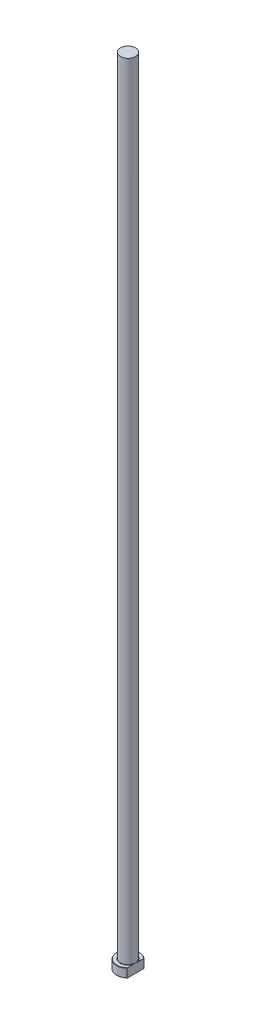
ISO-10303-21;
HEADER;
FILE_DESCRIPTION(('STEP AP214'),'2;1');
FILE_NAME('part.step','',(''),(''),'','','');
FILE_SCHEMA(('AUTOMOTIVE_DESIGN { 1 0 10303 214 1 1 1 1 }'));
ENDSEC;
DATA;
#1=APPLICATION_CONTEXT('core data for automotive mechanical design processes');
#2=APPLICATION_PROTOCOL_DEFINITION('international standard','automotive_design',2000,#1);
#3=PRODUCT_CONTEXT('',#1,'mechanical');
#4=PRODUCT('Part','Part','',(#3));
#5=PRODUCT_RELATED_PRODUCT_CATEGORY('part','',(#4));
#6=PRODUCT_DEFINITION_FORMATION('','',#4);
#7=PRODUCT_DEFINITION_CONTEXT('part definition',#1,'design');
#8=PRODUCT_DEFINITION('design','',#6,#7);
#9=PRODUCT_DEFINITION_SHAPE('','',#8);
#10=(LENGTH_UNIT() NAMED_UNIT(*) SI_UNIT(.MILLI.,.METRE.));
#11=(NAMED_UNIT(*) PLANE_ANGLE_UNIT() SI_UNIT($,.RADIAN.));
#12=(NAMED_UNIT(*) SI_UNIT($,.STERADIAN.) SOLID_ANGLE_UNIT());
#13=UNCERTAINTY_MEASURE_WITH_UNIT(LENGTH_MEASURE(1.E-05),#10,'distance_accuracy_value','');
#14=(GEOMETRIC_REPRESENTATION_CONTEXT(3) GLOBAL_UNCERTAINTY_ASSIGNED_CONTEXT((#13)) GLOBAL_UNIT_ASSIGNED_CONTEXT((#10,
#11,#12)) REPRESENTATION_CONTEXT('',''));
#15=CARTESIAN_POINT('',(0.,0.,0.));
#16=DIRECTION('',(0.,0.,1.));
#17=DIRECTION('',(1.,0.,0.));
#18=AXIS2_PLACEMENT_3D('',#15,#16,#17);
#19=CARTESIAN_POINT('',(0.,0.,0.));
#20=DIRECTION('',(0.,-1.,0.));
#21=DIRECTION('',(0.,0.,-1.));
#22=AXIS2_PLACEMENT_3D('',#19,#20,#21);
#23=PLANE('',#22);
#24=CARTESIAN_POINT('',(0.,0.,0.));
#25=DIRECTION('',(0.,-1.,0.));
#26=DIRECTION('',(0.,0.,-1.));
#27=AXIS2_PLACEMENT_3D('',#24,#25,#26);
#28=CIRCLE('',#27,8.79999999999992);
#29=CARTESIAN_POINT('',(5.99999999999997,0.,6.43739077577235));
#30=VERTEX_POINT('',#29);
#31=CARTESIAN_POINT('',(5.99999999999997,0.,-6.43739077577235));
#32=VERTEX_POINT('',#31);
#33=EDGE_CURVE('E98',#30,#32,#28,.T.);
#34=ORIENTED_EDGE('',*,*,#33,.T.);
#35=DIRECTION('',(0.,0.,1.));
#36=VECTOR('',#35,1.);
#37=CARTESIAN_POINT('',(5.99999999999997,0.,-6.70820393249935));
#38=LINE('',#37,#36);
#39=EDGE_CURVE('E83',#32,#30,#38,.T.);
#40=ORIENTED_EDGE('',*,*,#39,.T.);
#41=EDGE_LOOP('',(#34,#40));
#42=FACE_BOUND('',#41,.T.);
#43=ADVANCED_FACE('F32',(#42),#23,.T.);
#44=CARTESIAN_POINT('',(0.,259.958771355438,0.));
#45=DIRECTION('',(0.,1.,0.));
#46=DIRECTION('',(0.,0.,1.));
#47=AXIS2_PLACEMENT_3D('',#44,#45,#46);
#48=CYLINDRICAL_SURFACE('',#47,8.99999999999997);
#49=CARTESIAN_POINT('',(0.,6.79999999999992,0.));
#50=DIRECTION('',(0.,1.,0.));
#51=DIRECTION('',(0.,0.,1.));
#52=AXIS2_PLACEMENT_3D('',#49,#50,#51);
#53=CIRCLE('',#52,8.99999999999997);
#54=CARTESIAN_POINT('',(5.99999999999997,6.79999999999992,6.70820393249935));
#55=VERTEX_POINT('',#54);
#56=CARTESIAN_POINT('',(5.99999999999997,6.79999999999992,-6.70820393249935));
#57=VERTEX_POINT('',#56);
#58=EDGE_CURVE('E104',#55,#57,#53,.F.);
#59=ORIENTED_EDGE('',*,*,#58,.T.);
#60=DIRECTION('',(0.,-1.,0.));
#61=VECTOR('',#60,1.);
#62=CARTESIAN_POINT('',(5.99999999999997,630.,-6.70820393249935));
#63=LINE('',#62,#61);
#64=CARTESIAN_POINT('',(5.99999999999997,0.200000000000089,-6.70820393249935));
#65=VERTEX_POINT('',#64);
#66=EDGE_CURVE('E183',#57,#65,#63,.T.);
#67=ORIENTED_EDGE('',*,*,#66,.T.);
#68=CARTESIAN_POINT('',(0.,0.200000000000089,0.));
#69=DIRECTION('',(0.,-1.,0.));
#70=DIRECTION('',(0.,0.,-1.));
#71=AXIS2_PLACEMENT_3D('',#68,#69,#70);
#72=CIRCLE('',#71,8.99999999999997);
#73=CARTESIAN_POINT('',(5.99999999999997,0.200000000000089,6.70820393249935));
#74=VERTEX_POINT('',#73);
#75=EDGE_CURVE('E100',#65,#74,#72,.F.);
#76=ORIENTED_EDGE('',*,*,#75,.T.);
#77=DIRECTION('',(0.,-1.,0.));
#78=VECTOR('',#77,1.);
#79=CARTESIAN_POINT('',(5.99999999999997,630.,6.70820393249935));
#80=LINE('',#79,#78);
#81=EDGE_CURVE('E93',#55,#74,#80,.T.);
#82=ORIENTED_EDGE('',*,*,#81,.F.);
#83=EDGE_LOOP('',(#59,#67,#76,#82));
#84=FACE_BOUND('',#83,.T.);
#85=ADVANCED_FACE('F158',(#84),#48,.T.);
#86=CARTESIAN_POINT('',(-8.99999999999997,7.,0.));
#87=DIRECTION('',(0.,1.,0.));
#88=DIRECTION('',(0.,0.,1.));
#89=AXIS2_PLACEMENT_3D('',#86,#87,#88);
#90=PLANE('',#89);
#91=CARTESIAN_POINT('',(0.,7.,0.));
#92=DIRECTION('',(0.,1.,0.));
#93=DIRECTION('',(0.,0.,1.));
#94=AXIS2_PLACEMENT_3D('',#91,#92,#93);
#95=CIRCLE('',#94,8.79999999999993);
#96=CARTESIAN_POINT('',(5.99999999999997,7.,-6.43739077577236));
#97=VERTEX_POINT('',#96);
#98=CARTESIAN_POINT('',(5.99999999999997,7.,6.43739077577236));
#99=VERTEX_POINT('',#98);
#100=EDGE_CURVE('E178',#97,#99,#95,.T.);
#101=ORIENTED_EDGE('',*,*,#100,.T.);
#102=DIRECTION('',(0.,0.,-1.));
#103=VECTOR('',#102,1.);
#104=CARTESIAN_POINT('',(5.99999999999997,7.,0.));
#105=LINE('',#104,#103);
#106=CARTESIAN_POINT('',(5.99999999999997,6.99999999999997,1.92093727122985));
#107=VERTEX_POINT('',#106);
#108=EDGE_CURVE('E57',#99,#107,#105,.T.);
#109=ORIENTED_EDGE('',*,*,#108,.T.);
#110=CARTESIAN_POINT('',(0.,7.,0.));
#111=DIRECTION('',(0.,1.,0.));
#112=DIRECTION('',(0.,0.,1.));
#113=AXIS2_PLACEMENT_3D('',#110,#111,#112);
#114=CIRCLE('',#113,6.29999999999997);
#115=CARTESIAN_POINT('',(5.99999999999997,6.99999999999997,-1.92093727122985));
#116=VERTEX_POINT('',#115);
#117=EDGE_CURVE('E107',#107,#116,#114,.F.);
#118=ORIENTED_EDGE('',*,*,#117,.T.);
#119=EDGE_CURVE('E136',#116,#97,#105,.T.);
#120=ORIENTED_EDGE('',*,*,#119,.T.);
#121=EDGE_LOOP('',(#101,#109,#118,#120));
#122=FACE_BOUND('',#121,.T.);
#123=ADVANCED_FACE('F147',(#122),#90,.T.);
#124=CARTESIAN_POINT('',(0.,7.00000000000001,0.));
#125=DIRECTION('',(0.,-1.,0.));
#126=DIRECTION('',(0.,0.,-1.));
#127=AXIS2_PLACEMENT_3D('',#124,#125,#126);
#128=CONICAL_SURFACE('',#127,8.79999999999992,0.785398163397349);
#129=ORIENTED_EDGE('',*,*,#58,.F.);
#130=CARTESIAN_POINT('',(5.99999999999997,-0.132115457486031,14.7591430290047));
#131=CARTESIAN_POINT('',(5.99999999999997,0.0733919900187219,14.5372990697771));
#132=CARTESIAN_POINT('',(5.99999999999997,0.278550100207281,14.315131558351));
#133=CARTESIAN_POINT('',(5.99999999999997,0.688060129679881,13.8700519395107));
#134=CARTESIAN_POINT('',(5.99999999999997,0.892412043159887,13.6471398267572));
#135=CARTESIAN_POINT('',(5.99999999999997,1.50418032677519,12.9770492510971));
#136=CARTESIAN_POINT('',(5.99999999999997,1.91022091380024,12.5286117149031));
#137=CARTESIAN_POINT('',(5.99999999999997,2.71980134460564,11.624642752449));
#138=CARTESIAN_POINT('',(5.99999999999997,3.12331180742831,11.1690849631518));
#139=CARTESIAN_POINT('',(5.99999999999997,3.92341525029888,10.2520077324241));
#140=CARTESIAN_POINT('',(5.99999999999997,4.32000903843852,9.79048899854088));
#141=CARTESIAN_POINT('',(5.99999999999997,5.02478816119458,8.95241885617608));
#142=CARTESIAN_POINT('',(5.99999999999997,5.33476112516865,8.57737771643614));
#143=CARTESIAN_POINT('',(5.99999999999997,5.79310598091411,8.00939108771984));
#144=CARTESIAN_POINT('',(5.99999999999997,5.9448056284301,7.81913145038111));
#145=CARTESIAN_POINT('',(5.99999999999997,6.24553651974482,7.43651727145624));
#146=CARTESIAN_POINT('',(5.99999999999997,6.39456781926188,7.24416277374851));
#147=CARTESIAN_POINT('',(5.99999999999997,6.68925367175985,6.85721540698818));
#148=CARTESIAN_POINT('',(5.99999999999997,6.83491177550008,6.66262524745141));
#149=CARTESIAN_POINT('',(5.99999999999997,7.12230719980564,6.27057707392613));
#150=CARTESIAN_POINT('',(5.99999999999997,7.2640447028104,6.07311919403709));
#151=CARTESIAN_POINT('',(5.99999999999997,7.54263362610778,5.67488713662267));
#152=CARTESIAN_POINT('',(5.99999999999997,7.67948689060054,5.47411425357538));
#153=CARTESIAN_POINT('',(5.99999999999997,7.94714213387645,5.06858845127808));
#154=CARTESIAN_POINT('',(5.99999999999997,8.07794479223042,4.86383598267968));
#155=CARTESIAN_POINT('',(5.99999999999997,8.32827993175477,4.45554322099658));
#156=CARTESIAN_POINT('',(5.99999999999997,8.4480277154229,4.25213564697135));
#157=CARTESIAN_POINT('',(5.99999999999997,8.6783797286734,3.8401373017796));
#158=CARTESIAN_POINT('',(5.99999999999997,8.78898293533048,3.63154595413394));
#159=CARTESIAN_POINT('',(5.99999999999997,8.99840984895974,3.20863811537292));
#160=CARTESIAN_POINT('',(5.99999999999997,9.09724073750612,2.99432521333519));
#161=CARTESIAN_POINT('',(5.99999999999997,9.27991776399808,2.55937061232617));
#162=CARTESIAN_POINT('',(5.99999999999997,9.36376811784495,2.33873071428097));
#163=CARTESIAN_POINT('',(5.99999999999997,9.49627737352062,1.94012294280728));
#164=CARTESIAN_POINT('',(5.99999999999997,9.54862178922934,1.76338731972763));
#165=CARTESIAN_POINT('',(5.99999999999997,9.63978035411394,1.40643307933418));
#166=CARTESIAN_POINT('',(5.99999999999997,9.67859618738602,1.22621489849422));
#167=CARTESIAN_POINT('',(5.99999999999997,9.74077317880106,0.863704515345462));
#168=CARTESIAN_POINT('',(5.99999999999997,9.76418479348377,0.681421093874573));
#169=CARTESIAN_POINT('',(5.99999999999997,9.79447814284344,0.315473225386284));
#170=CARTESIAN_POINT('',(5.99999999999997,9.80136083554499,0.131808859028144));
#171=CARTESIAN_POINT('',(5.99999999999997,9.79818788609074,-0.235881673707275));
#172=CARTESIAN_POINT('',(5.99999999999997,9.78808514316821,-0.419907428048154));
#173=CARTESIAN_POINT('',(5.99999999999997,9.75144464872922,-0.786302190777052));
#174=CARTESIAN_POINT('',(5.99999999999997,9.7249055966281,-0.96867106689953));
#175=CARTESIAN_POINT('',(5.99999999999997,9.65670736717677,-1.33110767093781));
#176=CARTESIAN_POINT('',(5.99999999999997,9.61500120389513,-1.5111664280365));
#177=CARTESIAN_POINT('',(5.99999999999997,9.51838325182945,-1.86766519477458));
#178=CARTESIAN_POINT('',(5.99999999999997,9.46347085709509,-2.04410503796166));
#179=CARTESIAN_POINT('',(5.99999999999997,9.33563659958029,-2.41270922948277));
#180=CARTESIAN_POINT('',(5.99999999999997,9.26138327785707,-2.60440790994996));
#181=CARTESIAN_POINT('',(5.99999999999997,9.10155310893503,-2.98306496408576));
#182=CARTESIAN_POINT('',(5.99999999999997,9.01597146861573,-3.1700212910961));
#183=CARTESIAN_POINT('',(5.99999999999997,8.83553473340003,-3.53975380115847));
#184=CARTESIAN_POINT('',(5.99999999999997,8.74066449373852,-3.72252253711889));
#185=CARTESIAN_POINT('',(5.99999999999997,8.54355472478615,-4.08398624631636));
#186=CARTESIAN_POINT('',(5.99999999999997,8.44131612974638,-4.26268173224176));
#187=CARTESIAN_POINT('',(5.99999999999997,8.2295396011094,-4.61872309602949));
#188=CARTESIAN_POINT('',(5.99999999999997,8.11992610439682,-4.79602381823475));
#189=CARTESIAN_POINT('',(5.99999999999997,7.89571048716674,-5.14743548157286));
#190=CARTESIAN_POINT('',(5.99999999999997,7.78110825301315,-5.32154634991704));
#191=CARTESIAN_POINT('',(5.99999999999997,7.54792782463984,-5.6668232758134));
#192=CARTESIAN_POINT('',(5.99999999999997,7.42935372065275,-5.83799210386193));
#193=CARTESIAN_POINT('',(5.99999999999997,7.18881616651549,-6.17793707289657));
#194=CARTESIAN_POINT('',(5.99999999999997,7.06685256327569,-6.34671310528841));
#195=CARTESIAN_POINT('',(5.99999999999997,6.80539778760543,-6.70216781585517));
#196=CARTESIAN_POINT('',(5.99999999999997,6.6655496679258,-6.88858356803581));
#197=CARTESIAN_POINT('',(5.99999999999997,6.38292065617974,-7.25918139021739));
#198=CARTESIAN_POINT('',(5.99999999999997,6.24013967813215,-7.44336339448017));
#199=CARTESIAN_POINT('',(5.99999999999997,5.80812002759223,-7.99307414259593));
#200=CARTESIAN_POINT('',(5.99999999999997,5.51523002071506,-8.35573349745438));
#201=CARTESIAN_POINT('',(5.99999999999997,4.92224619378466,-9.07562940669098));
#202=CARTESIAN_POINT('',(5.99999999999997,4.62214609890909,-9.43286076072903));
#203=CARTESIAN_POINT('',(5.99999999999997,4.01677382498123,-10.1429201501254));
#204=CARTESIAN_POINT('',(5.99999999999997,3.71150152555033,-10.495748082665));
#205=CARTESIAN_POINT('',(5.99999999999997,3.11456796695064,-11.177916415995));
#206=CARTESIAN_POINT('',(5.99999999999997,2.82312451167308,-11.5074478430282));
#207=CARTESIAN_POINT('',(5.99999999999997,2.23747184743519,-12.1640528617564));
#208=CARTESIAN_POINT('',(5.99999999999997,1.94326258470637,-12.4911264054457));
#209=CARTESIAN_POINT('',(5.99999999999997,1.35320776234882,-13.1426363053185));
#210=CARTESIAN_POINT('',(5.99999999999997,1.05736649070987,-13.4670765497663));
#211=CARTESIAN_POINT('',(5.99999999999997,0.463882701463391,-14.1142803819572));
#212=CARTESIAN_POINT('',(5.99999999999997,0.16624026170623,-14.4370440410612));
#213=CARTESIAN_POINT('',(5.99999999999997,-0.13211545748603,-14.7591430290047));
#214=B_SPLINE_CURVE_WITH_KNOTS('',3,(#130,#131,#132,#133,#134,#135,#136,#137,#138,#139,#140,
#141,#142,#143,#144,#145,#146,#147,#148,#149,#150,#151,#152,#153,#154,#155,#156,#157,#158,#159,
#160,#161,#162,#163,#164,#165,#166,#167,#168,#169,#170,#171,#172,#173,#174,#175,#176,#177,#178,
#179,#180,#181,#182,#183,#184,#185,#186,#187,#188,#189,#190,#191,#192,#193,#194,#195,#196,#197,
#198,#199,#200,#201,#202,#203,#204,#205,#206,#207,#208,#209,#210,#211,#212,#213),.UNSPECIFIED.,
.F.,.F.,(4,2,2,2,2,2,2,2,2,2,2,2,2,2,2,2,2,2,2,2,2,2,2,2,2,2,2,2,2,2,2,2,2,2,2,2,2,2,2,2,2,4),
(0.,0.907210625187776,1.81442776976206,3.62925156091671,5.4549048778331,7.28034345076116,
8.73990838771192,9.46989218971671,10.1998607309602,10.9290223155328,11.6581499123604,
12.3869992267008,13.1157664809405,13.8236973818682,14.5317073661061,15.2392832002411,
15.9466595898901,16.4991819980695,17.0516356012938,17.6022705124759,18.1528735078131,
18.7050058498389,19.2571818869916,19.8110832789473,20.3650100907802,20.9812908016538,
21.597833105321,22.2153979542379,22.8328846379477,23.4581285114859,24.0833866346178,
24.7080195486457,25.3326807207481,26.0317691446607,26.7308780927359,28.1292235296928,
29.5288334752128,30.9284760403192,32.2482200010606,33.567989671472,34.8851960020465,
36.2023458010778),.UNSPECIFIED.);
#215=EDGE_CURVE('E135',#55,#99,#214,.T.);
#216=ORIENTED_EDGE('',*,*,#215,.T.);
#217=ORIENTED_EDGE('',*,*,#100,.F.);
#218=EDGE_CURVE('E127',#97,#57,#214,.T.);
#219=ORIENTED_EDGE('',*,*,#218,.T.);
#220=EDGE_LOOP('',(#129,#216,#217,#219));
#221=FACE_BOUND('',#220,.T.);
#222=ADVANCED_FACE('F143',(#221),#128,.T.);
#223=CARTESIAN_POINT('',(0.,0.200000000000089,0.));
#224=DIRECTION('',(0.,1.,0.));
#225=DIRECTION('',(0.,0.,1.));
#226=AXIS2_PLACEMENT_3D('',#223,#224,#225);
#227=CONICAL_SURFACE('',#226,8.99999999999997,0.785398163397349);
#228=ORIENTED_EDGE('',*,*,#75,.F.);
#229=CARTESIAN_POINT('',(5.99999999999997,7.13211545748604,-14.7591430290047));
#230=CARTESIAN_POINT('',(5.99999999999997,6.92660800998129,-14.5372990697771));
#231=CARTESIAN_POINT('',(5.99999999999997,6.72144989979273,-14.315131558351));
#232=CARTESIAN_POINT('',(5.99999999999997,6.31193987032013,-13.8700519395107));
#233=CARTESIAN_POINT('',(5.99999999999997,6.10758795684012,-13.6471398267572));
#234=CARTESIAN_POINT('',(5.99999999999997,5.49581967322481,-12.9770492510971));
#235=CARTESIAN_POINT('',(5.99999999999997,5.08977908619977,-12.5286117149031));
#236=CARTESIAN_POINT('',(5.99999999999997,4.28019865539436,-11.624642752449));
#237=CARTESIAN_POINT('',(5.99999999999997,3.87668819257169,-11.1690849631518));
#238=CARTESIAN_POINT('',(5.99999999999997,3.07658474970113,-10.2520077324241));
#239=CARTESIAN_POINT('',(5.99999999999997,2.67999096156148,-9.79048899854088));
#240=CARTESIAN_POINT('',(5.99999999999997,1.97521183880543,-8.95241885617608));
#241=CARTESIAN_POINT('',(5.99999999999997,1.66523887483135,-8.57737771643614));
#242=CARTESIAN_POINT('',(5.99999999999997,1.2068940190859,-8.00939108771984));
#243=CARTESIAN_POINT('',(5.99999999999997,1.05519437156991,-7.81913145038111));
#244=CARTESIAN_POINT('',(5.99999999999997,0.754463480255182,-7.43651727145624));
#245=CARTESIAN_POINT('',(5.99999999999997,0.605432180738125,-7.24416277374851));
#246=CARTESIAN_POINT('',(5.99999999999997,0.310746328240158,-6.85721540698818));
#247=CARTESIAN_POINT('',(5.99999999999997,0.165088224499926,-6.66262524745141));
#248=CARTESIAN_POINT('',(5.99999999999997,-0.122307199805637,-6.27057707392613));
#249=CARTESIAN_POINT('',(5.99999999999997,-0.264044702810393,-6.07311919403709));
#250=CARTESIAN_POINT('',(5.99999999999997,-0.542633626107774,-5.67488713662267));
#251=CARTESIAN_POINT('',(5.99999999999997,-0.679486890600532,-5.47411425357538));
#252=CARTESIAN_POINT('',(5.99999999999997,-0.947142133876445,-5.06858845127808));
#253=CARTESIAN_POINT('',(5.99999999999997,-1.07794479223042,-4.86383598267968));
#254=CARTESIAN_POINT('',(5.99999999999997,-1.32827993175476,-4.45554322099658));
#255=CARTESIAN_POINT('',(5.99999999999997,-1.44802771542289,-4.25213564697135));
#256=CARTESIAN_POINT('',(5.99999999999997,-1.6783797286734,-3.8401373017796));
#257=CARTESIAN_POINT('',(5.99999999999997,-1.78898293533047,-3.63154595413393));
#258=CARTESIAN_POINT('',(5.99999999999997,-1.99840984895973,-3.20863811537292));
#259=CARTESIAN_POINT('',(5.99999999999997,-2.09724073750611,-2.99432521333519));
#260=CARTESIAN_POINT('',(5.99999999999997,-2.27991776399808,-2.55937061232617));
#261=CARTESIAN_POINT('',(5.99999999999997,-2.36376811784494,-2.33873071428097));
#262=CARTESIAN_POINT('',(5.99999999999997,-2.49627737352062,-1.94012294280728));
#263=CARTESIAN_POINT('',(5.99999999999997,-2.54862178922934,-1.76338731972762));
#264=CARTESIAN_POINT('',(5.99999999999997,-2.63978035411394,-1.40643307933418));
#265=CARTESIAN_POINT('',(5.99999999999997,-2.67859618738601,-1.22621489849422));
#266=CARTESIAN_POINT('',(5.99999999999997,-2.74077317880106,-0.86370451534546));
#267=CARTESIAN_POINT('',(5.99999999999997,-2.76418479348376,-0.681421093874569));
#268=CARTESIAN_POINT('',(5.99999999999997,-2.79447814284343,-0.315473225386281));
#269=CARTESIAN_POINT('',(5.99999999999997,-2.80136083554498,-0.131808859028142));
#270=CARTESIAN_POINT('',(5.99999999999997,-2.79818788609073,0.235881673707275));
#271=CARTESIAN_POINT('',(5.99999999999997,-2.7880851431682,0.419907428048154));
#272=CARTESIAN_POINT('',(5.99999999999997,-2.75144464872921,0.786302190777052));
#273=CARTESIAN_POINT('',(5.99999999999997,-2.7249055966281,0.96867106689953));
#274=CARTESIAN_POINT('',(5.99999999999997,-2.65670736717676,1.33110767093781));
#275=CARTESIAN_POINT('',(5.99999999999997,-2.61500120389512,1.5111664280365));
#276=CARTESIAN_POINT('',(5.99999999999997,-2.51838325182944,1.86766519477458));
#277=CARTESIAN_POINT('',(5.99999999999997,-2.46347085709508,2.04410503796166));
#278=CARTESIAN_POINT('',(5.99999999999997,-2.33563659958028,2.41270922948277));
#279=CARTESIAN_POINT('',(5.99999999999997,-2.26138327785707,2.60440790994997));
#280=CARTESIAN_POINT('',(5.99999999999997,-2.10155310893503,2.98306496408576));
#281=CARTESIAN_POINT('',(5.99999999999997,-2.01597146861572,3.17002129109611));
#282=CARTESIAN_POINT('',(5.99999999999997,-1.83553473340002,3.53975380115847));
#283=CARTESIAN_POINT('',(5.99999999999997,-1.74066449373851,3.7225225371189));
#284=CARTESIAN_POINT('',(5.99999999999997,-1.54355472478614,4.08398624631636));
#285=CARTESIAN_POINT('',(5.99999999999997,-1.44131612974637,4.26268173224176));
#286=CARTESIAN_POINT('',(5.99999999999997,-1.22953960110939,4.6187230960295));
#287=CARTESIAN_POINT('',(5.99999999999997,-1.11992610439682,4.79602381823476));
#288=CARTESIAN_POINT('',(5.99999999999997,-0.895710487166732,5.14743548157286));
#289=CARTESIAN_POINT('',(5.99999999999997,-0.781108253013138,5.32154634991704));
#290=CARTESIAN_POINT('',(5.99999999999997,-0.547927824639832,5.6668232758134));
#291=CARTESIAN_POINT('',(5.99999999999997,-0.429353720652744,5.83799210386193));
#292=CARTESIAN_POINT('',(5.99999999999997,-0.188816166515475,6.17793707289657));
#293=CARTESIAN_POINT('',(5.99999999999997,-0.0668525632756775,6.34671310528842));
#294=CARTESIAN_POINT('',(5.99999999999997,0.194602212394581,6.70216781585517));
#295=CARTESIAN_POINT('',(5.99999999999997,0.334450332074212,6.88858356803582));
#296=CARTESIAN_POINT('',(5.99999999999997,0.617079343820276,7.2591813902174));
#297=CARTESIAN_POINT('',(5.99999999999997,0.759860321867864,7.44336339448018));
#298=CARTESIAN_POINT('',(5.99999999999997,1.19187997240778,7.99307414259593));
#299=CARTESIAN_POINT('',(5.99999999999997,1.48476997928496,8.35573349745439));
#300=CARTESIAN_POINT('',(5.99999999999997,2.07775380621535,9.07562940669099));
#301=CARTESIAN_POINT('',(5.99999999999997,2.37785390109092,9.43286076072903));
#302=CARTESIAN_POINT('',(5.99999999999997,2.98322617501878,10.1429201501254));
#303=CARTESIAN_POINT('',(5.99999999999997,3.28849847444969,10.495748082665));
#304=CARTESIAN_POINT('',(5.99999999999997,3.88543203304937,11.177916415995));
#305=CARTESIAN_POINT('',(5.99999999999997,4.17687548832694,11.5074478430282));
#306=CARTESIAN_POINT('',(5.99999999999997,4.76252815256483,12.1640528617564));
#307=CARTESIAN_POINT('',(5.99999999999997,5.05673741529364,12.4911264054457));
#308=CARTESIAN_POINT('',(5.99999999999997,5.64679223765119,13.1426363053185));
#309=CARTESIAN_POINT('',(5.99999999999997,5.94263350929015,13.4670765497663));
#310=CARTESIAN_POINT('',(5.99999999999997,6.53611729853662,14.1142803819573));
#311=CARTESIAN_POINT('',(5.99999999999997,6.83375973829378,14.4370440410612));
#312=CARTESIAN_POINT('',(5.99999999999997,7.13211545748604,14.7591430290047));
#313=B_SPLINE_CURVE_WITH_KNOTS('',3,(#229,#230,#231,#232,#233,#234,#235,#236,#237,#238,#239,
#240,#241,#242,#243,#244,#245,#246,#247,#248,#249,#250,#251,#252,#253,#254,#255,#256,#257,#258,
#259,#260,#261,#262,#263,#264,#265,#266,#267,#268,#269,#270,#271,#272,#273,#274,#275,#276,#277,
#278,#279,#280,#281,#282,#283,#284,#285,#286,#287,#288,#289,#290,#291,#292,#293,#294,#295,#296,
#297,#298,#299,#300,#301,#302,#303,#304,#305,#306,#307,#308,#309,#310,#311,#312),.UNSPECIFIED.,
.F.,.F.,(4,2,2,2,2,2,2,2,2,2,2,2,2,2,2,2,2,2,2,2,2,2,2,2,2,2,2,2,2,2,2,2,2,2,2,2,2,2,2,2,2,4),
(0.,0.907210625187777,1.81442776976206,3.62925156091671,5.4549048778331,7.28034345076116,
8.73990838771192,9.46989218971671,10.1998607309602,10.9290223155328,11.6581499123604,
12.3869992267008,13.1157664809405,13.8236973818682,14.5317073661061,15.2392832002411,
15.9466595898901,16.4991819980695,17.0516356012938,17.6022705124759,18.1528735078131,
18.7050058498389,19.2571818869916,19.8110832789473,20.3650100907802,20.9812908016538,
21.597833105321,22.2153979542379,22.8328846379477,23.4581285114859,24.0833866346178,
24.7080195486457,25.3326807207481,26.0317691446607,26.7308780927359,28.1292235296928,
29.5288334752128,30.9284760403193,32.2482200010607,33.567989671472,34.8851960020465,
36.2023458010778),.UNSPECIFIED.);
#314=EDGE_CURVE('E86',#65,#32,#313,.T.);
#315=ORIENTED_EDGE('',*,*,#314,.T.);
#316=ORIENTED_EDGE('',*,*,#33,.F.);
#317=EDGE_CURVE('E89',#30,#74,#313,.T.);
#318=ORIENTED_EDGE('',*,*,#317,.T.);
#319=EDGE_LOOP('',(#228,#315,#316,#318));
#320=FACE_BOUND('',#319,.T.);
#321=ADVANCED_FACE('F97',(#320),#227,.T.);
#322=CARTESIAN_POINT('',(0.,7.29999999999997,0.));
#323=DIRECTION('',(0.,1.,0.));
#324=DIRECTION('',(0.,0.,1.));
#325=AXIS2_PLACEMENT_3D('',#322,#323,#324);
#326=TOROIDAL_SURFACE('',#325,6.29999999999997,0.3);
#327=CARTESIAN_POINT('',(5.99999999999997,7.29999999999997,0.));
#328=CARTESIAN_POINT('',(5.99999999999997,7.30000062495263,1.34604287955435E-10));
#329=CARTESIAN_POINT('',(5.99999999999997,7.30000124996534,-2.85495107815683E-07));
#330=CARTESIAN_POINT('',(5.99999999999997,7.30000241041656,-1.04928090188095E-06));
#331=CARTESIAN_POINT('',(5.99999999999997,7.30000292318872,-1.54785170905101E-06));
#332=CARTESIAN_POINT('',(5.99999999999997,7.30000401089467,-2.74944383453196E-06));
#333=CARTESIAN_POINT('',(5.99999999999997,7.30000456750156,-3.47196539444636E-06));
#334=CARTESIAN_POINT('',(5.99999999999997,7.30000554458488,-4.95172582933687E-06));
#335=CARTESIAN_POINT('',(5.99999999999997,7.30000596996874,-5.70604365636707E-06));
#336=CARTESIAN_POINT('',(5.99999999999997,7.30000759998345,-8.69525109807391E-06));
#337=CARTESIAN_POINT('',(5.99999999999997,7.30000872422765,-1.0978182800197E-05));
#338=CARTESIAN_POINT('',(5.99999999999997,7.30001052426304,-1.54456346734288E-05));
#339=CARTESIAN_POINT('',(5.99999999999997,7.3000112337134,-1.76170762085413E-05));
#340=CARTESIAN_POINT('',(5.99999999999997,7.30001429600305,-2.69928123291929E-05));
#341=CARTESIAN_POINT('',(5.99999999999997,7.30001664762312,-3.42000265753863E-05));
#342=CARTESIAN_POINT('',(5.99999999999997,7.30002002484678,-4.76829001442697E-05));
#343=CARTESIAN_POINT('',(5.99999999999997,7.30002120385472,-5.39195609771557E-05));
#344=CARTESIAN_POINT('',(5.99999999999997,7.30002992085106,-0.000100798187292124));
#345=CARTESIAN_POINT('',(5.99999999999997,7.30003667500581,-0.00014152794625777));
#346=CARTESIAN_POINT('',(5.99999999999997,7.30006623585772,-0.000303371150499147));
#347=CARTESIAN_POINT('',(5.99999999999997,7.30009428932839,-0.000423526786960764));
#348=CARTESIAN_POINT('',(5.99999999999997,7.30020425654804,-0.000901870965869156));
#349=CARTESIAN_POINT('',(5.99999999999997,7.3002828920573,-0.00126055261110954));
#350=CARTESIAN_POINT('',(5.99999999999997,7.30059934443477,-0.0026940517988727));
#351=CARTESIAN_POINT('',(5.99999999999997,7.3008413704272,-0.0037682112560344));
#352=CARTESIAN_POINT('',(5.99999999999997,7.30185255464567,-0.0082672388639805));
#353=CARTESIAN_POINT('',(5.99999999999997,7.30261638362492,-0.0116929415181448));
#354=CARTESIAN_POINT('',(5.99999999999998,7.30945824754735,-0.0423635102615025));
#355=CARTESIAN_POINT('',(5.99999999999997,7.31555811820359,-0.0696050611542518));
#356=CARTESIAN_POINT('',(5.99999999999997,7.32747716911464,-0.122985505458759));
#357=CARTESIAN_POINT('',(5.99999999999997,7.33329766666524,-0.149124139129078));
#358=CARTESIAN_POINT('',(5.99999999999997,7.34565922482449,-0.204790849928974));
#359=CARTESIAN_POINT('',(5.99999999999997,7.352196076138,-0.234319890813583));
#360=CARTESIAN_POINT('',(5.99999999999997,7.36527652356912,-0.29372170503));
#361=CARTESIAN_POINT('',(5.99999999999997,7.37181938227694,-0.323594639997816));
#362=CARTESIAN_POINT('',(5.99999999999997,7.38741819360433,-0.395325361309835));
#363=CARTESIAN_POINT('',(5.99999999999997,7.39643140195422,-0.437192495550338));
#364=CARTESIAN_POINT('',(5.99999999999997,7.41397520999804,-0.519837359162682));
#365=CARTESIAN_POINT('',(5.99999999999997,7.4225122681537,-0.560613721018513));
#366=CARTESIAN_POINT('',(5.99999999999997,7.45005469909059,-0.694529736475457));
#367=CARTESIAN_POINT('',(5.99999999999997,7.46845270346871,-0.787796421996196));
#368=CARTESIAN_POINT('',(5.99999999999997,7.50309772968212,-0.975673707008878));
#369=CARTESIAN_POINT('',(5.99999999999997,7.51932210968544,-1.07028855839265));
#370=CARTESIAN_POINT('',(5.99999999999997,7.54979671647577,-1.26922112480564));
#371=CARTESIAN_POINT('',(5.99999999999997,7.56370439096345,-1.37359247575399));
#372=CARTESIAN_POINT('',(5.99999999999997,7.58567213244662,-1.58267692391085));
#373=CARTESIAN_POINT('',(5.99999999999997,7.59375049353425,-1.68738790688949));
#374=CARTESIAN_POINT('',(5.99999999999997,7.59943466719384,-1.8430899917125));
#375=CARTESIAN_POINT('',(5.99999999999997,7.60029184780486,-1.89396002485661));
#376=CARTESIAN_POINT('',(5.99999999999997,7.5995288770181,-1.99574511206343));
#377=CARTESIAN_POINT('',(5.99999999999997,7.59790613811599,-2.04666015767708));
#378=CARTESIAN_POINT('',(5.99999999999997,7.59158346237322,-2.14740525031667));
#379=CARTESIAN_POINT('',(5.99999999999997,7.58693864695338,-2.19723851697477));
#380=CARTESIAN_POINT('',(5.99999999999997,7.57369485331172,-2.29634018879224));
#381=CARTESIAN_POINT('',(5.99999999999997,7.56510170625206,-2.3456093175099));
#382=CARTESIAN_POINT('',(5.99999999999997,7.54513600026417,-2.43101613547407));
#383=CARTESIAN_POINT('',(5.99999999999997,7.53495732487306,-2.46741817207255));
#384=CARTESIAN_POINT('',(5.99999999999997,7.5163599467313,-2.52083307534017));
#385=CARTESIAN_POINT('',(5.99999999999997,7.50961541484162,-2.53842082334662));
#386=CARTESIAN_POINT('',(5.99999999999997,7.49476050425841,-2.57300282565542));
#387=CARTESIAN_POINT('',(5.99999999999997,7.48665036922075,-2.58999718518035));
#388=CARTESIAN_POINT('',(5.99999999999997,7.4656679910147,-2.62872971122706));
#389=CARTESIAN_POINT('',(5.99999999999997,7.45211281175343,-2.65012863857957));
#390=CARTESIAN_POINT('',(5.99999999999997,7.42848584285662,-2.67978235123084));
#391=CARTESIAN_POINT('',(5.99999999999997,7.42001211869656,-2.68929941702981));
#392=CARTESIAN_POINT('',(5.99999999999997,7.40175979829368,-2.70700164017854));
#393=CARTESIAN_POINT('',(5.99999999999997,7.39198420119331,-2.71518976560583));
#394=CARTESIAN_POINT('',(5.99999999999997,7.37475773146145,-2.7269570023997));
#395=CARTESIAN_POINT('',(5.99999999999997,7.36772137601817,-2.73113834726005));
#396=CARTESIAN_POINT('',(5.99999999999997,7.35309194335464,-2.73838811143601));
#397=CARTESIAN_POINT('',(5.99999999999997,7.34549938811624,-2.7414575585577));
#398=CARTESIAN_POINT('',(5.99999999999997,7.32979919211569,-2.74623687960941));
#399=CARTESIAN_POINT('',(5.99999999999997,7.32168697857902,-2.74793213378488));
#400=CARTESIAN_POINT('',(5.99999999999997,7.30528814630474,-2.74970225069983));
#401=CARTESIAN_POINT('',(5.99999999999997,7.29700168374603,-2.74977850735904));
#402=CARTESIAN_POINT('',(5.99999999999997,7.2816016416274,-2.74839814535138));
#403=CARTESIAN_POINT('',(5.99999999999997,7.27447007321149,-2.74713049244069));
#404=CARTESIAN_POINT('',(5.99999999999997,7.26050316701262,-2.74347158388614));
#405=CARTESIAN_POINT('',(5.99999999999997,7.25366802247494,-2.7410796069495));
#406=CARTESIAN_POINT('',(5.99999999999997,7.23783277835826,-2.73423902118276));
#407=CARTESIAN_POINT('',(5.99999999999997,7.22902314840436,-2.72935244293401));
#408=CARTESIAN_POINT('',(5.99999999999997,7.21228574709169,-2.7182516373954));
#409=CARTESIAN_POINT('',(5.99999999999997,7.20436026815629,-2.71203407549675));
#410=CARTESIAN_POINT('',(5.99999999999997,7.18433696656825,-2.69420240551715));
#411=CARTESIAN_POINT('',(5.99999999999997,7.17298706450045,-2.68175715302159));
#412=CARTESIAN_POINT('',(5.99999999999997,7.15219498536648,-2.65539556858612));
#413=CARTESIAN_POINT('',(5.99999999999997,7.14275658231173,-2.64147640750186));
#414=CARTESIAN_POINT('',(5.99999999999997,7.12508934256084,-2.61223187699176));
#415=CARTESIAN_POINT('',(5.99999999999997,7.11691464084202,-2.59687428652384));
#416=CARTESIAN_POINT('',(5.99999999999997,7.10186133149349,-2.56552911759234));
#417=CARTESIAN_POINT('',(5.99999999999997,7.09498416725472,-2.54954086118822));
#418=CARTESIAN_POINT('',(5.99999999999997,7.07586257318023,-2.50075322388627));
#419=CARTESIAN_POINT('',(5.99999999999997,7.06523495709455,-2.46732486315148));
#420=CARTESIAN_POINT('',(5.99999999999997,7.04175411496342,-2.38014114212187));
#421=CARTESIAN_POINT('',(5.99999999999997,7.0311656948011,-2.32580591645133));
#422=CARTESIAN_POINT('',(5.99999999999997,7.01502027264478,-2.21628778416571));
#423=CARTESIAN_POINT('',(5.99999999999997,7.00947977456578,-2.16110269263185));
#424=CARTESIAN_POINT('',(5.99999999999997,7.00227593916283,-2.05225433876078));
#425=CARTESIAN_POINT('',(5.99999999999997,7.00049528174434,-1.99859827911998));
#426=CARTESIAN_POINT('',(5.99999999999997,6.99968738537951,-1.89155586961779));
#427=CARTESIAN_POINT('',(5.99999999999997,7.00064591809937,-1.83816956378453));
#428=CARTESIAN_POINT('',(5.99999999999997,7.00516082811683,-1.72092619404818));
#429=CARTESIAN_POINT('',(5.99999999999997,7.0091939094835,-1.65708843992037));
#430=CARTESIAN_POINT('',(5.99999999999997,7.01973827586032,-1.52965474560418));
#431=CARTESIAN_POINT('',(5.99999999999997,7.02624848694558,-1.46605871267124));
#432=CARTESIAN_POINT('',(5.99999999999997,7.04143114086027,-1.33760082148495));
#433=CARTESIAN_POINT('',(5.99999999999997,7.05015116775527,-1.27274468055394));
#434=CARTESIAN_POINT('',(5.99999999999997,7.06927542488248,-1.14310871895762));
#435=CARTESIAN_POINT('',(5.99999999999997,7.07968406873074,-1.07832955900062));
#436=CARTESIAN_POINT('',(5.99999999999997,7.10594320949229,-0.924890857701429));
#437=CARTESIAN_POINT('',(5.99999999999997,7.12237584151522,-0.836331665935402));
#438=CARTESIAN_POINT('',(5.99999999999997,7.15676035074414,-0.660568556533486));
#439=CARTESIAN_POINT('',(5.99999999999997,7.17469265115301,-0.573360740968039));
#440=CARTESIAN_POINT('',(5.99999999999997,7.20946366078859,-0.409309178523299));
#441=CARTESIAN_POINT('',(5.99999999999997,7.22618667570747,-0.332440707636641));
#442=CARTESIAN_POINT('',(5.99999999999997,7.25202386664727,-0.215187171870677));
#443=CARTESIAN_POINT('',(5.99999999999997,7.26098977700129,-0.174768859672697));
#444=CARTESIAN_POINT('',(5.99999999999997,7.27885525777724,-0.0946083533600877));
#445=CARTESIAN_POINT('',(5.99999999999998,7.28775352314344,-0.0548658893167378));
#446=CARTESIAN_POINT('',(5.99999999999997,7.2973853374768,-0.0116849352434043));
#447=CARTESIAN_POINT('',(5.99999999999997,7.29815099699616,-0.0082512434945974));
#448=CARTESIAN_POINT('',(5.99999999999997,7.2991626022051,-0.00375043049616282));
#449=CARTESIAN_POINT('',(5.99999999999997,7.29940322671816,-0.00268247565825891));
#450=CARTESIAN_POINT('',(5.99999999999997,7.29971797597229,-0.0012566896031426));
#451=CARTESIAN_POINT('',(5.99999999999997,7.2997962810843,-0.000899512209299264));
#452=CARTESIAN_POINT('',(5.99999999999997,7.2999058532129,-0.000422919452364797));
#453=CARTESIAN_POINT('',(5.99999999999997,7.29993385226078,-0.000303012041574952));
#454=CARTESIAN_POINT('',(5.99999999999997,7.299963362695,-0.000141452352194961));
#455=CARTESIAN_POINT('',(5.99999999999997,7.29997011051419,-0.000100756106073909));
#456=CARTESIAN_POINT('',(5.99999999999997,7.29997881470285,-5.39118915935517E-05));
#457=CARTESIAN_POINT('',(5.99999999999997,7.29997999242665,-4.76769647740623E-05));
#458=CARTESIAN_POINT('',(5.99999999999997,7.29998336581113,-3.41977669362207E-05));
#459=CARTESIAN_POINT('',(5.99999999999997,7.29998571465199,-2.69924043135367E-05));
#460=CARTESIAN_POINT('',(5.99999999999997,7.29998877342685,-1.76186229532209E-05));
#461=CARTESIAN_POINT('',(5.99999999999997,7.29998948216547,-1.54473107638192E-05));
#462=CARTESIAN_POINT('',(5.99999999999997,7.29999128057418,-1.09800124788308E-05));
#463=CARTESIAN_POINT('',(5.99999999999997,7.29999240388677,-8.69708706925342E-06));
#464=CARTESIAN_POINT('',(5.99999999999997,7.29999403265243,-5.70776681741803E-06));
#465=CARTESIAN_POINT('',(5.99999999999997,7.29999445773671,-4.95337952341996E-06));
#466=CARTESIAN_POINT('',(5.99999999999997,7.29999543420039,-3.47342608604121E-06));
#467=CARTESIAN_POINT('',(5.99999999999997,7.29999599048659,-2.7507782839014E-06));
#468=CARTESIAN_POINT('',(5.99999999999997,7.29999707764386,-1.54889527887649E-06));
#469=CARTESIAN_POINT('',(5.99999999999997,7.29999759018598,-1.0501721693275E-06));
#470=CARTESIAN_POINT('',(5.99999999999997,7.29999875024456,-2.85992424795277E-07));
#471=CARTESIAN_POINT('',(5.99999999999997,7.29999937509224,-1.34594612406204E-10));
#472=CARTESIAN_POINT('',(5.99999999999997,7.29999999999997,0.));
#473=B_SPLINE_CURVE_WITH_KNOTS('',3,(#327,#328,#329,#330,#331,#332,#333,#334,#335,#336,#337,
#338,#339,#340,#341,#342,#343,#344,#345,#346,#347,#348,#349,#350,#351,#352,#353,#354,#355,#356,
#357,#358,#359,#360,#361,#362,#363,#364,#365,#366,#367,#368,#369,#370,#371,#372,#373,#374,#375,
#376,#377,#378,#379,#380,#381,#382,#383,#384,#385,#386,#387,#388,#389,#390,#391,#392,#393,#394,
#395,#396,#397,#398,#399,#400,#401,#402,#403,#404,#405,#406,#407,#408,#409,#410,#411,#412,#413,
#414,#415,#416,#417,#418,#419,#420,#421,#422,#423,#424,#425,#426,#427,#428,#429,#430,#431,#432,
#433,#434,#435,#436,#437,#438,#439,#440,#441,#442,#443,#444,#445,#446,#447,#448,#449,#450,#451,
#452,#453,#454,#455,#456,#457,#458,#459,#460,#461,#462,#463,#464,#465,#466,#467,#468,#469,#470,
#471,#472),.UNSPECIFIED.,.T.,.F.,(4,2,2,2,2,2,2,2,2,2,2,2,2,2,2,2,2,2,2,2,2,2,2,2,2,2,2,2,2,2,2,
2,2,2,2,2,2,2,2,2,2,2,2,2,2,2,2,2,2,2,2,2,2,2,2,2,2,2,2,2,2,2,2,2,2,2,2,2,2,2,2,2,4),(0.,
1.90630853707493E-06,4.0638928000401E-06,6.78060422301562E-06,9.37792731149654E-06,
1.69875448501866E-05,2.38342815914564E-05,4.65460519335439E-05,6.55661832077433E-05,
0.000189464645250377,0.000559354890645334,0.001661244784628,0.00496415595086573,
0.0154940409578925,0.0992404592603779,0.179577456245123,0.270309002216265,0.362052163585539,
0.490530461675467,0.615511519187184,0.900684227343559,1.1886283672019,1.50441328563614,
1.8192028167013,1.97178950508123,2.1245355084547,2.27457076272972,2.4243851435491,
2.53755667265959,2.59401506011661,2.65046338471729,2.72600079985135,2.76413970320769,
2.80219221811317,2.82667181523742,2.85112872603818,2.8758425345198,2.90053506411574,
2.92216471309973,2.94380825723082,2.97385970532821,3.00398734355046,3.05423323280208,
3.10457737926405,3.15668997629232,3.20886020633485,3.31385890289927,3.47955406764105,
3.64578904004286,3.80675522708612,3.96688682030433,4.15871791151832,4.35046593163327,
4.54675795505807,4.74357155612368,5.01375693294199,5.2808448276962,5.51684158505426,
5.64104475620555,5.76322108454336,5.77377554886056,5.77705938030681,5.77815664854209,
5.77852577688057,5.77864957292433,5.77866858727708,5.77869129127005,5.77869813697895,
5.77870574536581,5.77870834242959,5.77871105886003,5.77871321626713,5.77871512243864),.UNSPECIFIED.);
#474=CARTESIAN_POINT('',(5.99999999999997,7.29999999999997,0.));
#475=VERTEX_POINT('',#474);
#476=EDGE_CURVE('E11',#116,#475,#473,.T.);
#477=ORIENTED_EDGE('',*,*,#476,.F.);
#478=ORIENTED_EDGE('',*,*,#117,.F.);
#479=CARTESIAN_POINT('',(5.99999999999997,7.29999999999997,0.));
#480=CARTESIAN_POINT('',(5.99999999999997,7.29999937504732,-1.34604253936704E-10));
#481=CARTESIAN_POINT('',(5.99999999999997,7.29999875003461,2.85495107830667E-07));
#482=CARTESIAN_POINT('',(5.99999999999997,7.29999758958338,1.04928090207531E-06));
#483=CARTESIAN_POINT('',(5.99999999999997,7.29999707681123,1.54785170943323E-06));
#484=CARTESIAN_POINT('',(5.99999999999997,7.29999598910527,2.74944383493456E-06));
#485=CARTESIAN_POINT('',(5.99999999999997,7.29999543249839,3.47196539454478E-06));
#486=CARTESIAN_POINT('',(5.99999999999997,7.29999445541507,4.95172582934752E-06));
#487=CARTESIAN_POINT('',(5.99999999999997,7.29999403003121,5.70604365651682E-06));
#488=CARTESIAN_POINT('',(5.99999999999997,7.2999924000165,8.69525109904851E-06));
#489=CARTESIAN_POINT('',(5.99999999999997,7.2999912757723,1.09781828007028E-05));
#490=CARTESIAN_POINT('',(5.99999999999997,7.29998947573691,1.54456346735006E-05));
#491=CARTESIAN_POINT('',(5.99999999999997,7.29998876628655,1.76170762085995E-05));
#492=CARTESIAN_POINT('',(5.99999999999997,7.2999857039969,2.69928123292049E-05));
#493=CARTESIAN_POINT('',(5.99999999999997,7.29998335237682,3.42000265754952E-05));
#494=CARTESIAN_POINT('',(5.99999999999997,7.29997997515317,4.76829001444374E-05));
#495=CARTESIAN_POINT('',(5.99999999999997,7.29997879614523,5.39195609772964E-05));
#496=CARTESIAN_POINT('',(5.99999999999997,7.29997007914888,0.000100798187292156));
#497=CARTESIAN_POINT('',(5.99999999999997,7.29996332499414,0.000141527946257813));
#498=CARTESIAN_POINT('',(5.99999999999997,7.29993376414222,0.000303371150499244));
#499=CARTESIAN_POINT('',(5.99999999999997,7.29990571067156,0.00042352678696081));
#500=CARTESIAN_POINT('',(5.99999999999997,7.29979574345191,0.00090187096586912));
#501=CARTESIAN_POINT('',(5.99999999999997,7.29971710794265,0.00126055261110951));
#502=CARTESIAN_POINT('',(5.99999999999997,7.29940065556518,0.0026940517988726));
#503=CARTESIAN_POINT('',(5.99999999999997,7.29915862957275,0.00376821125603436));
#504=CARTESIAN_POINT('',(5.99999999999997,7.29814744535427,0.00826723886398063));
#505=CARTESIAN_POINT('',(5.99999999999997,7.29738361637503,0.0116929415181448));
#506=CARTESIAN_POINT('',(5.99999999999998,7.2905417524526,0.0423635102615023));
#507=CARTESIAN_POINT('',(5.99999999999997,7.28444188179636,0.0696050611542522));
#508=CARTESIAN_POINT('',(5.99999999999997,7.2725228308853,0.12298550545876));
#509=CARTESIAN_POINT('',(5.99999999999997,7.26670233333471,0.149124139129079));
#510=CARTESIAN_POINT('',(5.99999999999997,7.25434077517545,0.204790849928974));
#511=CARTESIAN_POINT('',(5.99999999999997,7.24780392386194,0.234319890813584));
#512=CARTESIAN_POINT('',(5.99999999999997,7.23472347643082,0.29372170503));
#513=CARTESIAN_POINT('',(5.99999999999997,7.228180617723,0.323594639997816));
#514=CARTESIAN_POINT('',(5.99999999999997,7.21258180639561,0.395325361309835));
#515=CARTESIAN_POINT('',(5.99999999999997,7.20356859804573,0.437192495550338));
#516=CARTESIAN_POINT('',(5.99999999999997,7.18602479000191,0.519837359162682));
#517=CARTESIAN_POINT('',(5.99999999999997,7.17748773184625,0.560613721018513));
#518=CARTESIAN_POINT('',(5.99999999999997,7.14994530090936,0.694529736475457));
#519=CARTESIAN_POINT('',(5.99999999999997,7.13154729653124,0.787796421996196));
#520=CARTESIAN_POINT('',(5.99999999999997,7.09690227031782,0.975673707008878));
#521=CARTESIAN_POINT('',(5.99999999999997,7.08067789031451,1.07028855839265));
#522=CARTESIAN_POINT('',(5.99999999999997,7.05020328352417,1.26922112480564));
#523=CARTESIAN_POINT('',(5.99999999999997,7.0362956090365,1.37359247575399));
#524=CARTESIAN_POINT('',(5.99999999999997,7.01432786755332,1.58267692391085));
#525=CARTESIAN_POINT('',(5.99999999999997,7.0062495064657,1.68738790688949));
#526=CARTESIAN_POINT('',(5.99999999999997,7.00056533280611,1.8430899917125));
#527=CARTESIAN_POINT('',(5.99999999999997,6.99970815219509,1.89396002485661));
#528=CARTESIAN_POINT('',(5.99999999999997,7.00047112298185,1.99574511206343));
#529=CARTESIAN_POINT('',(5.99999999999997,7.00209386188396,2.04666015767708));
#530=CARTESIAN_POINT('',(5.99999999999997,7.00841653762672,2.14740525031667));
#531=CARTESIAN_POINT('',(5.99999999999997,7.01306135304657,2.19723851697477));
#532=CARTESIAN_POINT('',(5.99999999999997,7.02630514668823,2.29634018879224));
#533=CARTESIAN_POINT('',(5.99999999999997,7.03489829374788,2.3456093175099));
#534=CARTESIAN_POINT('',(5.99999999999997,7.05486399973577,2.43101613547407));
#535=CARTESIAN_POINT('',(5.99999999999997,7.06504267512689,2.46741817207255));
#536=CARTESIAN_POINT('',(5.99999999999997,7.08364005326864,2.52083307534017));
#537=CARTESIAN_POINT('',(5.99999999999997,7.09038458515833,2.53842082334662));
#538=CARTESIAN_POINT('',(5.99999999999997,7.10523949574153,2.57300282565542));
#539=CARTESIAN_POINT('',(5.99999999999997,7.1133496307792,2.58999718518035));
#540=CARTESIAN_POINT('',(5.99999999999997,7.13433200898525,2.62872971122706));
#541=CARTESIAN_POINT('',(5.99999999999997,7.14788718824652,2.65012863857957));
#542=CARTESIAN_POINT('',(5.99999999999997,7.17151415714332,2.67978235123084));
#543=CARTESIAN_POINT('',(5.99999999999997,7.17998788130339,2.68929941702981));
#544=CARTESIAN_POINT('',(5.99999999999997,7.19824020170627,2.70700164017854));
#545=CARTESIAN_POINT('',(5.99999999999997,7.20801579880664,2.71518976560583));
#546=CARTESIAN_POINT('',(5.99999999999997,7.2252422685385,2.7269570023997));
#547=CARTESIAN_POINT('',(5.99999999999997,7.23227862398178,2.73113834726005));
#548=CARTESIAN_POINT('',(5.99999999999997,7.24690805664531,2.73838811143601));
#549=CARTESIAN_POINT('',(5.99999999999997,7.2545006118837,2.7414575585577));
#550=CARTESIAN_POINT('',(5.99999999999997,7.27020080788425,2.74623687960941));
#551=CARTESIAN_POINT('',(5.99999999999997,7.27831302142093,2.74793213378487));
#552=CARTESIAN_POINT('',(5.99999999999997,7.29471185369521,2.74970225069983));
#553=CARTESIAN_POINT('',(5.99999999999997,7.30299831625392,2.74977850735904));
#554=CARTESIAN_POINT('',(5.99999999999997,7.31839835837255,2.74839814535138));
#555=CARTESIAN_POINT('',(5.99999999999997,7.32552992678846,2.74713049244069));
#556=CARTESIAN_POINT('',(5.99999999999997,7.33949683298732,2.74347158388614));
#557=CARTESIAN_POINT('',(5.99999999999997,7.34633197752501,2.7410796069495));
#558=CARTESIAN_POINT('',(5.99999999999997,7.36216722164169,2.73423902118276));
#559=CARTESIAN_POINT('',(5.99999999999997,7.37097685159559,2.72935244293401));
#560=CARTESIAN_POINT('',(5.99999999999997,7.38771425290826,2.7182516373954));
#561=CARTESIAN_POINT('',(5.99999999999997,7.39563973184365,2.71203407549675));
#562=CARTESIAN_POINT('',(5.99999999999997,7.4156630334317,2.69420240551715));
#563=CARTESIAN_POINT('',(5.99999999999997,7.42701293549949,2.68175715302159));
#564=CARTESIAN_POINT('',(5.99999999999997,7.44780501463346,2.65539556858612));
#565=CARTESIAN_POINT('',(5.99999999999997,7.45724341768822,2.64147640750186));
#566=CARTESIAN_POINT('',(5.99999999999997,7.4749106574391,2.61223187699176));
#567=CARTESIAN_POINT('',(5.99999999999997,7.48308535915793,2.59687428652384));
#568=CARTESIAN_POINT('',(5.99999999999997,7.49813866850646,2.56552911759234));
#569=CARTESIAN_POINT('',(5.99999999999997,7.50501583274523,2.54954086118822));
#570=CARTESIAN_POINT('',(5.99999999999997,7.52413742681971,2.50075322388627));
#571=CARTESIAN_POINT('',(5.99999999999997,7.5347650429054,2.46732486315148));
#572=CARTESIAN_POINT('',(5.99999999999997,7.55824588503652,2.38014114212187));
#573=CARTESIAN_POINT('',(5.99999999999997,7.56883430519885,2.32580591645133));
#574=CARTESIAN_POINT('',(5.99999999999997,7.58497972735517,2.21628778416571));
#575=CARTESIAN_POINT('',(5.99999999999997,7.59052022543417,2.16110269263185));
#576=CARTESIAN_POINT('',(5.99999999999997,7.59772406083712,2.05225433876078));
#577=CARTESIAN_POINT('',(5.99999999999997,7.5995047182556,1.99859827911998));
#578=CARTESIAN_POINT('',(5.99999999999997,7.60031261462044,1.89155586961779));
#579=CARTESIAN_POINT('',(5.99999999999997,7.59935408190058,1.83816956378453));
#580=CARTESIAN_POINT('',(5.99999999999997,7.59483917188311,1.72092619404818));
#581=CARTESIAN_POINT('',(5.99999999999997,7.59080609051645,1.65708843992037));
#582=CARTESIAN_POINT('',(5.99999999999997,7.58026172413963,1.52965474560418));
#583=CARTESIAN_POINT('',(5.99999999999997,7.57375151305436,1.46605871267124));
#584=CARTESIAN_POINT('',(5.99999999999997,7.55856885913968,1.33760082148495));
#585=CARTESIAN_POINT('',(5.99999999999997,7.54984883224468,1.27274468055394));
#586=CARTESIAN_POINT('',(5.99999999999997,7.53072457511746,1.14310871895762));
#587=CARTESIAN_POINT('',(5.99999999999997,7.5203159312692,1.07832955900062));
#588=CARTESIAN_POINT('',(5.99999999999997,7.49405679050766,0.924890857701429));
#589=CARTESIAN_POINT('',(5.99999999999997,7.47762415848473,0.836331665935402));
#590=CARTESIAN_POINT('',(5.99999999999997,7.44323964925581,0.660568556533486));
#591=CARTESIAN_POINT('',(5.99999999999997,7.42530734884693,0.57336074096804));
#592=CARTESIAN_POINT('',(5.99999999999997,7.39053633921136,0.409309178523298));
#593=CARTESIAN_POINT('',(5.99999999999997,7.37381332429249,0.332440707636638));
#594=CARTESIAN_POINT('',(5.99999999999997,7.34797613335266,0.215187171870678));
#595=CARTESIAN_POINT('',(5.99999999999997,7.33901022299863,0.174768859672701));
#596=CARTESIAN_POINT('',(5.99999999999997,7.32114474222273,0.094608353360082));
#597=CARTESIAN_POINT('',(5.99999999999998,7.31224647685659,0.0548658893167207));
#598=CARTESIAN_POINT('',(5.99999999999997,7.30261466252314,0.0116849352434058));
#599=CARTESIAN_POINT('',(5.99999999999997,7.30184900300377,0.00825124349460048));
#600=CARTESIAN_POINT('',(5.99999999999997,7.30083739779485,0.00375043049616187));
#601=CARTESIAN_POINT('',(5.99999999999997,7.30059677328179,0.00268247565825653));
#602=CARTESIAN_POINT('',(5.99999999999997,7.30028202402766,0.00125668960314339));
#603=CARTESIAN_POINT('',(5.99999999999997,7.30020371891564,0.000899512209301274));
#604=CARTESIAN_POINT('',(5.99999999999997,7.30009414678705,0.000422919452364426));
#605=CARTESIAN_POINT('',(5.99999999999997,7.30006614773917,0.000303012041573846));
#606=CARTESIAN_POINT('',(5.99999999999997,7.30003663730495,0.000141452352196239));
#607=CARTESIAN_POINT('',(5.99999999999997,7.30002988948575,0.000100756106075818));
#608=CARTESIAN_POINT('',(5.99999999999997,7.3000211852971,5.39118915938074E-05));
#609=CARTESIAN_POINT('',(5.99999999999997,7.3000200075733,4.76769647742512E-05));
#610=CARTESIAN_POINT('',(5.99999999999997,7.30001663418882,3.41977669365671E-05));
#611=CARTESIAN_POINT('',(5.99999999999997,7.30001428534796,2.69924043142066E-05));
#612=CARTESIAN_POINT('',(5.99999999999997,7.3000112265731,1.76186229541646E-05));
#613=CARTESIAN_POINT('',(5.99999999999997,7.30001051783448,1.54473107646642E-05));
#614=CARTESIAN_POINT('',(5.99999999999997,7.30000871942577,1.09800124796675E-05));
#615=CARTESIAN_POINT('',(5.99999999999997,7.30000759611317,8.69708707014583E-06));
#616=CARTESIAN_POINT('',(5.99999999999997,7.30000596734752,5.70776681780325E-06));
#617=CARTESIAN_POINT('',(5.99999999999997,7.30000554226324,4.95337952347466E-06));
#618=CARTESIAN_POINT('',(5.99999999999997,7.30000456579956,3.47342608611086E-06));
#619=CARTESIAN_POINT('',(5.99999999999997,7.30000400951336,2.75077828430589E-06));
#620=CARTESIAN_POINT('',(5.99999999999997,7.30000292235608,1.54889527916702E-06));
#621=CARTESIAN_POINT('',(5.99999999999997,7.30000240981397,1.05017216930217E-06));
#622=CARTESIAN_POINT('',(5.99999999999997,7.30000124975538,2.85992424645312E-07));
#623=CARTESIAN_POINT('',(5.99999999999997,7.3000006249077,1.34594578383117E-10));
#624=CARTESIAN_POINT('',(5.99999999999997,7.29999999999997,0.));
#625=B_SPLINE_CURVE_WITH_KNOTS('',3,(#479,#480,#481,#482,#483,#484,#485,#486,#487,#488,#489,
#490,#491,#492,#493,#494,#495,#496,#497,#498,#499,#500,#501,#502,#503,#504,#505,#506,#507,#508,
#509,#510,#511,#512,#513,#514,#515,#516,#517,#518,#519,#520,#521,#522,#523,#524,#525,#526,#527,
#528,#529,#530,#531,#532,#533,#534,#535,#536,#537,#538,#539,#540,#541,#542,#543,#544,#545,#546,
#547,#548,#549,#550,#551,#552,#553,#554,#555,#556,#557,#558,#559,#560,#561,#562,#563,#564,#565,
#566,#567,#568,#569,#570,#571,#572,#573,#574,#575,#576,#577,#578,#579,#580,#581,#582,#583,#584,
#585,#586,#587,#588,#589,#590,#591,#592,#593,#594,#595,#596,#597,#598,#599,#600,#601,#602,#603,
#604,#605,#606,#607,#608,#609,#610,#611,#612,#613,#614,#615,#616,#617,#618,#619,#620,#621,#622,
#623,#624),.UNSPECIFIED.,.T.,.F.,(4,2,2,2,2,2,2,2,2,2,2,2,2,2,2,2,2,2,2,2,2,2,2,2,2,2,2,2,2,2,2,
2,2,2,2,2,2,2,2,2,2,2,2,2,2,2,2,2,2,2,2,2,2,2,2,2,2,2,2,2,2,2,2,2,2,2,2,2,2,2,2,2,4),(0.,
1.90630853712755E-06,4.06389279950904E-06,6.78060422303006E-06,9.3779273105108E-06,
1.6987544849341E-05,2.38342815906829E-05,4.65460519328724E-05,6.55661832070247E-05,
0.000189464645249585,0.000559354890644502,0.00166124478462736,0.00496415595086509,
0.0154940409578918,0.099240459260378,0.179577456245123,0.270309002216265,0.362052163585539,
0.490530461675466,0.615511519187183,0.900684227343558,1.1886283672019,1.50441328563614,
1.8192028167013,1.97178950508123,2.1245355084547,2.27457076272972,2.4243851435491,
2.53755667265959,2.59401506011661,2.65046338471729,2.72600079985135,2.76413970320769,
2.80219221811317,2.82667181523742,2.85112872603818,2.8758425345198,2.90053506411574,
2.92216471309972,2.94380825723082,2.97385970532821,3.00398734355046,3.05423323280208,
3.10457737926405,3.15668997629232,3.20886020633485,3.31385890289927,3.47955406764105,
3.64578904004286,3.80675522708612,3.96688682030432,4.15871791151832,4.35046593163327,
4.54675795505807,4.74357155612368,5.01375693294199,5.2808448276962,5.51684158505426,
5.64104475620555,5.76322108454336,5.77377554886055,5.77705938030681,5.77815664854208,
5.77852577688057,5.77864957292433,5.77866858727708,5.77869129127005,5.77869813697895,
5.77870574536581,5.77870834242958,5.77871105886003,5.77871321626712,5.77871512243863),.UNSPECIFIED.);
#626=EDGE_CURVE('E46',#475,#107,#625,.T.);
#627=ORIENTED_EDGE('',*,*,#626,.F.);
#628=CARTESIAN_POINT('',(0.,7.29999999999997,0.));
#629=DIRECTION('',(0.,1.,0.));
#630=DIRECTION('',(0.,0.,1.));
#631=AXIS2_PLACEMENT_3D('',#628,#629,#630);
#632=CIRCLE('',#631,5.99999999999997);
#633=EDGE_CURVE('E103',#475,#475,#632,.T.);
#634=ORIENTED_EDGE('',*,*,#633,.F.);
#635=EDGE_LOOP('',(#477,#478,#627,#634));
#636=FACE_BOUND('',#635,.T.);
#637=ADVANCED_FACE('F34',(#636),#326,.F.);
#638=CARTESIAN_POINT('',(0.,259.958771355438,0.));
#639=DIRECTION('',(0.,1.,0.));
#640=DIRECTION('',(0.,0.,1.));
#641=AXIS2_PLACEMENT_3D('',#638,#639,#640);
#642=CYLINDRICAL_SURFACE('',#641,5.99999999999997);
#643=ORIENTED_EDGE('',*,*,#633,.T.);
#644=EDGE_LOOP('',(#643));
#645=FACE_BOUND('',#644,.T.);
#646=CARTESIAN_POINT('',(0.,630.,0.));
#647=DIRECTION('',(0.,1.,0.));
#648=DIRECTION('',(0.,0.,1.));
#649=AXIS2_PLACEMENT_3D('',#646,#647,#648);
#650=CIRCLE('',#649,5.99999999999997);
#651=CARTESIAN_POINT('',(0.,630.,5.99999999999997));
#652=VERTEX_POINT('',#651);
#653=EDGE_CURVE('E101',#652,#652,#650,.T.);
#654=ORIENTED_EDGE('',*,*,#653,.F.);
#655=EDGE_LOOP('',(#654));
#656=FACE_BOUND('',#655,.T.);
#657=ADVANCED_FACE('F155',(#645,#656),#642,.T.);
#658=CARTESIAN_POINT('',(-5.99999999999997,630.,0.));
#659=DIRECTION('',(0.,1.,0.));
#660=DIRECTION('',(0.,0.,1.));
#661=AXIS2_PLACEMENT_3D('',#658,#659,#660);
#662=PLANE('',#661);
#663=ORIENTED_EDGE('',*,*,#653,.T.);
#664=EDGE_LOOP('',(#663));
#665=FACE_BOUND('',#664,.T.);
#666=ADVANCED_FACE('F121',(#665),#662,.T.);
#667=CARTESIAN_POINT('',(5.99999999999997,630.,-6.70820393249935));
#668=DIRECTION('',(1.,0.,0.));
#669=DIRECTION('',(0.,0.,-1.));
#670=AXIS2_PLACEMENT_3D('',#667,#668,#669);
#671=PLANE('',#670);
#672=ORIENTED_EDGE('',*,*,#66,.F.);
#673=ORIENTED_EDGE('',*,*,#218,.F.);
#674=ORIENTED_EDGE('',*,*,#119,.F.);
#675=ORIENTED_EDGE('',*,*,#476,.T.);
#676=ORIENTED_EDGE('',*,*,#626,.T.);
#677=ORIENTED_EDGE('',*,*,#108,.F.);
#678=ORIENTED_EDGE('',*,*,#215,.F.);
#679=ORIENTED_EDGE('',*,*,#81,.T.);
#680=ORIENTED_EDGE('',*,*,#317,.F.);
#681=ORIENTED_EDGE('',*,*,#39,.F.);
#682=ORIENTED_EDGE('',*,*,#314,.F.);
#683=EDGE_LOOP('',(#672,#673,#674,#675,#676,#677,#678,#679,#680,#681,#682));
#684=FACE_BOUND('',#683,.T.);
#685=ADVANCED_FACE('F85',(#684),#671,.T.);
#686=CLOSED_SHELL('',(#43,#85,#123,#222,#321,#637,#657,#666,#685));
#687=MANIFOLD_SOLID_BREP('B2',#686);
#688=ADVANCED_BREP_SHAPE_REPRESENTATION('',(#18,#687),#14);
#689=SHAPE_DEFINITION_REPRESENTATION(#9,#688);
ENDSEC;
END-ISO-10303-21;
